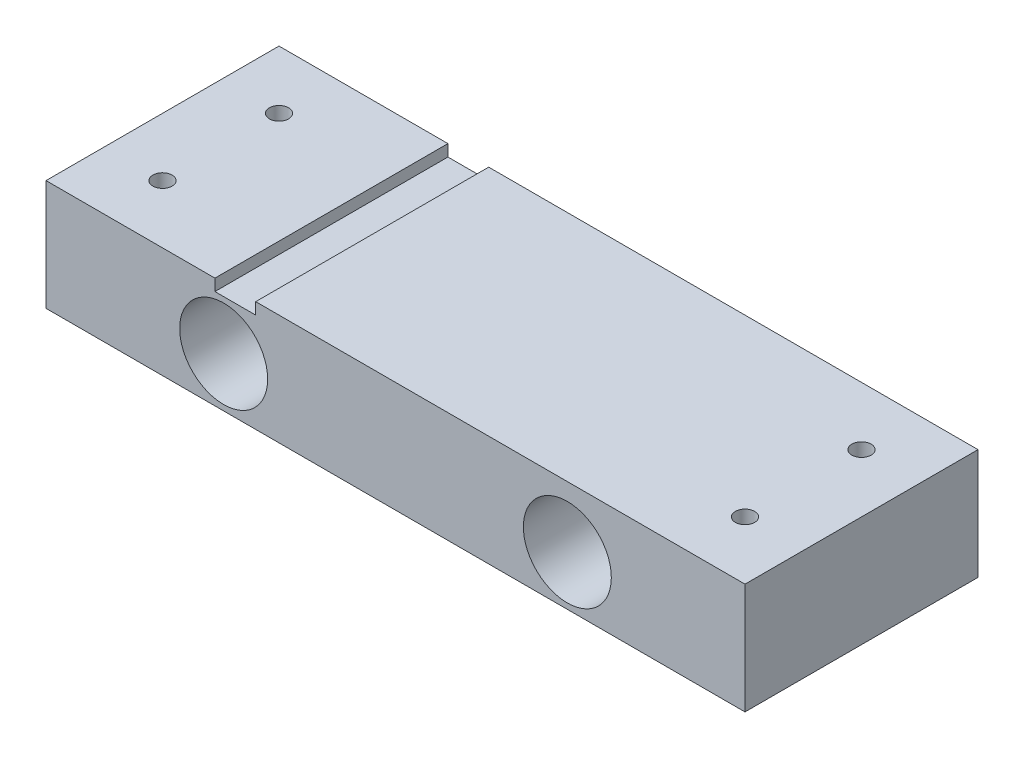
ISO-10303-21;
HEADER;
FILE_DESCRIPTION(('STEP AP214'),'2;1');
FILE_NAME('part.step','',(''),(''),'','','');
FILE_SCHEMA(('AUTOMOTIVE_DESIGN { 1 0 10303 214 1 1 1 1 }'));
ENDSEC;
DATA;
#1=APPLICATION_CONTEXT('core data for automotive mechanical design processes');
#2=APPLICATION_PROTOCOL_DEFINITION('international standard','automotive_design',2000,#1);
#3=PRODUCT_CONTEXT('',#1,'mechanical');
#4=PRODUCT('Part','Part','',(#3));
#5=PRODUCT_RELATED_PRODUCT_CATEGORY('part','',(#4));
#6=PRODUCT_DEFINITION_FORMATION('','',#4);
#7=PRODUCT_DEFINITION_CONTEXT('part definition',#1,'design');
#8=PRODUCT_DEFINITION('design','',#6,#7);
#9=PRODUCT_DEFINITION_SHAPE('','',#8);
#10=(LENGTH_UNIT() NAMED_UNIT(*) SI_UNIT(.MILLI.,.METRE.));
#11=(NAMED_UNIT(*) PLANE_ANGLE_UNIT() SI_UNIT($,.RADIAN.));
#12=(NAMED_UNIT(*) SI_UNIT($,.STERADIAN.) SOLID_ANGLE_UNIT());
#13=UNCERTAINTY_MEASURE_WITH_UNIT(LENGTH_MEASURE(1.E-05),#10,'distance_accuracy_value','');
#14=(GEOMETRIC_REPRESENTATION_CONTEXT(3) GLOBAL_UNCERTAINTY_ASSIGNED_CONTEXT((#13)) GLOBAL_UNIT_ASSIGNED_CONTEXT((#10,
#11,#12)) REPRESENTATION_CONTEXT('',''));
#15=CARTESIAN_POINT('',(0.,0.,0.));
#16=DIRECTION('',(0.,0.,1.));
#17=DIRECTION('',(1.,0.,0.));
#18=AXIS2_PLACEMENT_3D('',#15,#16,#17);
#19=CARTESIAN_POINT('',(0.,0.,40.));
#20=DIRECTION('',(0.,0.,1.));
#21=DIRECTION('',(1.,0.,0.));
#22=AXIS2_PLACEMENT_3D('',#19,#20,#21);
#23=PLANE('',#22);
#24=CARTESIAN_POINT('',(29.5,0.5,40.));
#25=DIRECTION('',(0.,0.,1.));
#26=DIRECTION('',(1.,0.,0.));
#27=AXIS2_PLACEMENT_3D('',#24,#25,#26);
#28=CIRCLE('',#27,7.55);
#29=CARTESIAN_POINT('',(37.05,0.5,40.));
#30=VERTEX_POINT('',#29);
#31=EDGE_CURVE('E138',#30,#30,#28,.T.);
#32=ORIENTED_EDGE('',*,*,#31,.F.);
#33=EDGE_LOOP('',(#32));
#34=FACE_BOUND('',#33,.T.);
#35=DIRECTION('',(-1.,0.,0.));
#36=VECTOR('',#35,1.);
#37=CARTESIAN_POINT('',(-24.,11.,40.));
#38=LINE('',#37,#36);
#39=CARTESIAN_POINT('',(60.,11.,40.));
#40=VERTEX_POINT('',#39);
#41=CARTESIAN_POINT('',(-24.,11.,40.));
#42=VERTEX_POINT('',#41);
#43=EDGE_CURVE('E149',#40,#42,#38,.T.);
#44=ORIENTED_EDGE('',*,*,#43,.T.);
#45=DIRECTION('',(0.,-1.,0.));
#46=VECTOR('',#45,1.);
#47=CARTESIAN_POINT('',(-24.,11.,40.));
#48=LINE('',#47,#46);
#49=CARTESIAN_POINT('',(-24.,9.,40.));
#50=VERTEX_POINT('',#49);
#51=EDGE_CURVE('E97',#42,#50,#48,.T.);
#52=ORIENTED_EDGE('',*,*,#51,.T.);
#53=DIRECTION('',(-1.,0.,0.));
#54=VECTOR('',#53,1.);
#55=CARTESIAN_POINT('',(-31.,9.,40.));
#56=LINE('',#55,#54);
#57=CARTESIAN_POINT('',(-31.,9.,40.));
#58=VERTEX_POINT('',#57);
#59=EDGE_CURVE('E164',#50,#58,#56,.T.);
#60=ORIENTED_EDGE('',*,*,#59,.T.);
#61=DIRECTION('',(0.,1.,0.));
#62=VECTOR('',#61,1.);
#63=CARTESIAN_POINT('',(-31.,11.,40.));
#64=LINE('',#63,#62);
#65=CARTESIAN_POINT('',(-31.,11.,40.));
#66=VERTEX_POINT('',#65);
#67=EDGE_CURVE('E177',#58,#66,#64,.T.);
#68=ORIENTED_EDGE('',*,*,#67,.T.);
#69=DIRECTION('',(-1.,0.,0.));
#70=VECTOR('',#69,1.);
#71=CARTESIAN_POINT('',(-60.,11.,40.));
#72=LINE('',#71,#70);
#73=CARTESIAN_POINT('',(-60.,11.,40.));
#74=VERTEX_POINT('',#73);
#75=EDGE_CURVE('E116',#66,#74,#72,.T.);
#76=ORIENTED_EDGE('',*,*,#75,.T.);
#77=DIRECTION('',(0.,-1.,0.));
#78=VECTOR('',#77,1.);
#79=CARTESIAN_POINT('',(-60.,-8.,40.));
#80=LINE('',#79,#78);
#81=CARTESIAN_POINT('',(-60.,-8.,40.));
#82=VERTEX_POINT('',#81);
#83=EDGE_CURVE('E110',#74,#82,#80,.T.);
#84=ORIENTED_EDGE('',*,*,#83,.T.);
#85=DIRECTION('',(1.,0.,0.));
#86=VECTOR('',#85,1.);
#87=CARTESIAN_POINT('',(-60.,-8.,40.));
#88=LINE('',#87,#86);
#89=CARTESIAN_POINT('',(60.,-8.,40.));
#90=VERTEX_POINT('',#89);
#91=EDGE_CURVE('E114',#82,#90,#88,.T.);
#92=ORIENTED_EDGE('',*,*,#91,.T.);
#93=DIRECTION('',(0.,1.,0.));
#94=VECTOR('',#93,1.);
#95=CARTESIAN_POINT('',(60.,-8.,40.));
#96=LINE('',#95,#94);
#97=EDGE_CURVE('E54',#90,#40,#96,.T.);
#98=ORIENTED_EDGE('',*,*,#97,.T.);
#99=EDGE_LOOP('',(#44,#52,#60,#68,#76,#84,#92,#98));
#100=FACE_BOUND('',#99,.T.);
#101=CARTESIAN_POINT('',(-29.5,0.5,40.));
#102=DIRECTION('',(0.,0.,1.));
#103=DIRECTION('',(1.,0.,0.));
#104=AXIS2_PLACEMENT_3D('',#101,#102,#103);
#105=CIRCLE('',#104,7.55);
#106=CARTESIAN_POINT('',(-21.95,0.5,40.));
#107=VERTEX_POINT('',#106);
#108=EDGE_CURVE('E186',#107,#107,#105,.T.);
#109=ORIENTED_EDGE('',*,*,#108,.F.);
#110=EDGE_LOOP('',(#109));
#111=FACE_BOUND('',#110,.T.);
#112=ADVANCED_FACE('F37',(#34,#100,#111),#23,.T.);
#113=CARTESIAN_POINT('',(0.,0.,0.));
#114=DIRECTION('',(0.,0.,1.));
#115=DIRECTION('',(1.,0.,0.));
#116=AXIS2_PLACEMENT_3D('',#113,#114,#115);
#117=PLANE('',#116);
#118=DIRECTION('',(-1.,0.,0.));
#119=VECTOR('',#118,1.);
#120=CARTESIAN_POINT('',(-24.,11.,0.));
#121=LINE('',#120,#119);
#122=CARTESIAN_POINT('',(60.,11.,0.));
#123=VERTEX_POINT('',#122);
#124=CARTESIAN_POINT('',(-24.,11.,0.));
#125=VERTEX_POINT('',#124);
#126=EDGE_CURVE('E134',#123,#125,#121,.T.);
#127=ORIENTED_EDGE('',*,*,#126,.F.);
#128=DIRECTION('',(0.,1.,0.));
#129=VECTOR('',#128,1.);
#130=CARTESIAN_POINT('',(60.,-8.,0.));
#131=LINE('',#130,#129);
#132=CARTESIAN_POINT('',(60.,-8.,0.));
#133=VERTEX_POINT('',#132);
#134=EDGE_CURVE('E89',#133,#123,#131,.T.);
#135=ORIENTED_EDGE('',*,*,#134,.F.);
#136=DIRECTION('',(1.,0.,0.));
#137=VECTOR('',#136,1.);
#138=CARTESIAN_POINT('',(-60.,-8.,0.));
#139=LINE('',#138,#137);
#140=CARTESIAN_POINT('',(-60.,-8.,0.));
#141=VERTEX_POINT('',#140);
#142=EDGE_CURVE('E83',#141,#133,#139,.T.);
#143=ORIENTED_EDGE('',*,*,#142,.F.);
#144=DIRECTION('',(0.,-1.,0.));
#145=VECTOR('',#144,1.);
#146=CARTESIAN_POINT('',(-60.,-8.,0.));
#147=LINE('',#146,#145);
#148=CARTESIAN_POINT('',(-60.,11.,0.));
#149=VERTEX_POINT('',#148);
#150=EDGE_CURVE('E124',#149,#141,#147,.T.);
#151=ORIENTED_EDGE('',*,*,#150,.F.);
#152=DIRECTION('',(-1.,0.,0.));
#153=VECTOR('',#152,1.);
#154=CARTESIAN_POINT('',(-60.,11.,0.));
#155=LINE('',#154,#153);
#156=CARTESIAN_POINT('',(-31.,11.,0.));
#157=VERTEX_POINT('',#156);
#158=EDGE_CURVE('E144',#157,#149,#155,.T.);
#159=ORIENTED_EDGE('',*,*,#158,.F.);
#160=DIRECTION('',(0.,1.,0.));
#161=VECTOR('',#160,1.);
#162=CARTESIAN_POINT('',(-31.,11.,0.));
#163=LINE('',#162,#161);
#164=CARTESIAN_POINT('',(-31.,9.,0.));
#165=VERTEX_POINT('',#164);
#166=EDGE_CURVE('E142',#165,#157,#163,.T.);
#167=ORIENTED_EDGE('',*,*,#166,.F.);
#168=DIRECTION('',(-1.,0.,0.));
#169=VECTOR('',#168,1.);
#170=CARTESIAN_POINT('',(-31.,9.,0.));
#171=LINE('',#170,#169);
#172=CARTESIAN_POINT('',(-24.,9.,0.));
#173=VERTEX_POINT('',#172);
#174=EDGE_CURVE('E140',#173,#165,#171,.T.);
#175=ORIENTED_EDGE('',*,*,#174,.F.);
#176=DIRECTION('',(0.,-1.,0.));
#177=VECTOR('',#176,1.);
#178=CARTESIAN_POINT('',(-24.,11.,0.));
#179=LINE('',#178,#177);
#180=EDGE_CURVE('E137',#125,#173,#179,.T.);
#181=ORIENTED_EDGE('',*,*,#180,.F.);
#182=EDGE_LOOP('',(#127,#135,#143,#151,#159,#167,#175,#181));
#183=FACE_BOUND('',#182,.T.);
#184=CARTESIAN_POINT('',(29.5,0.5,0.));
#185=DIRECTION('',(0.,0.,1.));
#186=DIRECTION('',(1.,0.,0.));
#187=AXIS2_PLACEMENT_3D('',#184,#185,#186);
#188=CIRCLE('',#187,7.55);
#189=CARTESIAN_POINT('',(37.05,0.5,0.));
#190=VERTEX_POINT('',#189);
#191=EDGE_CURVE('E183',#190,#190,#188,.T.);
#192=ORIENTED_EDGE('',*,*,#191,.T.);
#193=EDGE_LOOP('',(#192));
#194=FACE_BOUND('',#193,.T.);
#195=CARTESIAN_POINT('',(-29.5,0.5,0.));
#196=DIRECTION('',(0.,0.,1.));
#197=DIRECTION('',(1.,0.,0.));
#198=AXIS2_PLACEMENT_3D('',#195,#196,#197);
#199=CIRCLE('',#198,7.55);
#200=CARTESIAN_POINT('',(-21.95,0.5,0.));
#201=VERTEX_POINT('',#200);
#202=EDGE_CURVE('E189',#201,#201,#199,.T.);
#203=ORIENTED_EDGE('',*,*,#202,.T.);
#204=EDGE_LOOP('',(#203));
#205=FACE_BOUND('',#204,.T.);
#206=ADVANCED_FACE('F168',(#183,#194,#205),#117,.F.);
#207=CARTESIAN_POINT('',(-24.,11.,40.));
#208=DIRECTION('',(0.,-1.,0.));
#209=DIRECTION('',(0.,0.,-1.));
#210=AXIS2_PLACEMENT_3D('',#207,#208,#209);
#211=PLANE('',#210);
#212=CARTESIAN_POINT('',(50.,11.,30.));
#213=DIRECTION('',(0.,1.,0.));
#214=DIRECTION('',(-1.,0.,0.));
#215=AXIS2_PLACEMENT_3D('',#212,#213,#214);
#216=CIRCLE('',#215,1.65);
#217=CARTESIAN_POINT('',(48.35,11.,30.));
#218=VERTEX_POINT('',#217);
#219=EDGE_CURVE('E210',#218,#218,#216,.T.);
#220=ORIENTED_EDGE('',*,*,#219,.F.);
#221=EDGE_LOOP('',(#220));
#222=FACE_BOUND('',#221,.T.);
#223=CARTESIAN_POINT('',(50.,11.,10.));
#224=DIRECTION('',(0.,1.,0.));
#225=DIRECTION('',(-1.,0.,0.));
#226=AXIS2_PLACEMENT_3D('',#223,#224,#225);
#227=CIRCLE('',#226,1.65);
#228=CARTESIAN_POINT('',(48.35,11.,10.));
#229=VERTEX_POINT('',#228);
#230=EDGE_CURVE('E198',#229,#229,#227,.T.);
#231=ORIENTED_EDGE('',*,*,#230,.F.);
#232=EDGE_LOOP('',(#231));
#233=FACE_BOUND('',#232,.T.);
#234=ORIENTED_EDGE('',*,*,#126,.T.);
#235=DIRECTION('',(0.,0.,-1.));
#236=VECTOR('',#235,1.);
#237=CARTESIAN_POINT('',(-24.,11.,40.));
#238=LINE('',#237,#236);
#239=EDGE_CURVE('E11',#42,#125,#238,.T.);
#240=ORIENTED_EDGE('',*,*,#239,.F.);
#241=ORIENTED_EDGE('',*,*,#43,.F.);
#242=DIRECTION('',(0.,0.,-1.));
#243=VECTOR('',#242,1.);
#244=CARTESIAN_POINT('',(60.,11.,40.));
#245=LINE('',#244,#243);
#246=EDGE_CURVE('E130',#40,#123,#245,.T.);
#247=ORIENTED_EDGE('',*,*,#246,.T.);
#248=EDGE_LOOP('',(#234,#240,#241,#247));
#249=FACE_BOUND('',#248,.T.);
#250=ADVANCED_FACE('F39',(#222,#233,#249),#211,.F.);
#251=CARTESIAN_POINT('',(-24.,11.,40.));
#252=DIRECTION('',(1.,0.,0.));
#253=DIRECTION('',(0.,0.,-1.));
#254=AXIS2_PLACEMENT_3D('',#251,#252,#253);
#255=PLANE('',#254);
#256=ORIENTED_EDGE('',*,*,#180,.T.);
#257=DIRECTION('',(0.,0.,-1.));
#258=VECTOR('',#257,1.);
#259=CARTESIAN_POINT('',(-24.,9.,40.));
#260=LINE('',#259,#258);
#261=EDGE_CURVE('E46',#50,#173,#260,.T.);
#262=ORIENTED_EDGE('',*,*,#261,.F.);
#263=ORIENTED_EDGE('',*,*,#51,.F.);
#264=ORIENTED_EDGE('',*,*,#239,.T.);
#265=EDGE_LOOP('',(#256,#262,#263,#264));
#266=FACE_BOUND('',#265,.T.);
#267=ADVANCED_FACE('F223',(#266),#255,.F.);
#268=CARTESIAN_POINT('',(-31.,9.,40.));
#269=DIRECTION('',(0.,-1.,0.));
#270=DIRECTION('',(0.,0.,-1.));
#271=AXIS2_PLACEMENT_3D('',#268,#269,#270);
#272=PLANE('',#271);
#273=ORIENTED_EDGE('',*,*,#174,.T.);
#274=DIRECTION('',(0.,0.,-1.));
#275=VECTOR('',#274,1.);
#276=CARTESIAN_POINT('',(-31.,9.,40.));
#277=LINE('',#276,#275);
#278=EDGE_CURVE('E156',#58,#165,#277,.T.);
#279=ORIENTED_EDGE('',*,*,#278,.F.);
#280=ORIENTED_EDGE('',*,*,#59,.F.);
#281=ORIENTED_EDGE('',*,*,#261,.T.);
#282=EDGE_LOOP('',(#273,#279,#280,#281));
#283=FACE_BOUND('',#282,.T.);
#284=ADVANCED_FACE('F162',(#283),#272,.F.);
#285=CARTESIAN_POINT('',(-31.,11.,40.));
#286=DIRECTION('',(-1.,0.,0.));
#287=DIRECTION('',(0.,0.,1.));
#288=AXIS2_PLACEMENT_3D('',#285,#286,#287);
#289=PLANE('',#288);
#290=ORIENTED_EDGE('',*,*,#166,.T.);
#291=DIRECTION('',(0.,0.,-1.));
#292=VECTOR('',#291,1.);
#293=CARTESIAN_POINT('',(-31.,11.,40.));
#294=LINE('',#293,#292);
#295=EDGE_CURVE('E153',#66,#157,#294,.T.);
#296=ORIENTED_EDGE('',*,*,#295,.F.);
#297=ORIENTED_EDGE('',*,*,#67,.F.);
#298=ORIENTED_EDGE('',*,*,#278,.T.);
#299=EDGE_LOOP('',(#290,#296,#297,#298));
#300=FACE_BOUND('',#299,.T.);
#301=ADVANCED_FACE('F173',(#300),#289,.F.);
#302=CARTESIAN_POINT('',(-60.,11.,40.));
#303=DIRECTION('',(0.,-1.,0.));
#304=DIRECTION('',(0.,0.,-1.));
#305=AXIS2_PLACEMENT_3D('',#302,#303,#304);
#306=PLANE('',#305);
#307=CARTESIAN_POINT('',(-50.,11.,30.));
#308=DIRECTION('',(0.,1.,0.));
#309=DIRECTION('',(-1.,0.,0.));
#310=AXIS2_PLACEMENT_3D('',#307,#308,#309);
#311=CIRCLE('',#310,1.65);
#312=CARTESIAN_POINT('',(-51.65,11.,30.));
#313=VERTEX_POINT('',#312);
#314=EDGE_CURVE('E204',#313,#313,#311,.T.);
#315=ORIENTED_EDGE('',*,*,#314,.F.);
#316=EDGE_LOOP('',(#315));
#317=FACE_BOUND('',#316,.T.);
#318=CARTESIAN_POINT('',(-50.,11.,10.));
#319=DIRECTION('',(0.,1.,0.));
#320=DIRECTION('',(-1.,0.,0.));
#321=AXIS2_PLACEMENT_3D('',#318,#319,#320);
#322=CIRCLE('',#321,1.65);
#323=CARTESIAN_POINT('',(-51.65,11.,10.));
#324=VERTEX_POINT('',#323);
#325=EDGE_CURVE('E195',#324,#324,#322,.T.);
#326=ORIENTED_EDGE('',*,*,#325,.F.);
#327=EDGE_LOOP('',(#326));
#328=FACE_BOUND('',#327,.T.);
#329=ORIENTED_EDGE('',*,*,#158,.T.);
#330=DIRECTION('',(0.,0.,-1.));
#331=VECTOR('',#330,1.);
#332=CARTESIAN_POINT('',(-60.,11.,40.));
#333=LINE('',#332,#331);
#334=EDGE_CURVE('E125',#74,#149,#333,.T.);
#335=ORIENTED_EDGE('',*,*,#334,.F.);
#336=ORIENTED_EDGE('',*,*,#75,.F.);
#337=ORIENTED_EDGE('',*,*,#295,.T.);
#338=EDGE_LOOP('',(#329,#335,#336,#337));
#339=FACE_BOUND('',#338,.T.);
#340=ADVANCED_FACE('F176',(#317,#328,#339),#306,.F.);
#341=CARTESIAN_POINT('',(-60.,-8.,40.));
#342=DIRECTION('',(1.,0.,0.));
#343=DIRECTION('',(0.,0.,-1.));
#344=AXIS2_PLACEMENT_3D('',#341,#342,#343);
#345=PLANE('',#344);
#346=ORIENTED_EDGE('',*,*,#150,.T.);
#347=DIRECTION('',(0.,0.,-1.));
#348=VECTOR('',#347,1.);
#349=CARTESIAN_POINT('',(-60.,-8.,40.));
#350=LINE('',#349,#348);
#351=EDGE_CURVE('E121',#82,#141,#350,.T.);
#352=ORIENTED_EDGE('',*,*,#351,.F.);
#353=ORIENTED_EDGE('',*,*,#83,.F.);
#354=ORIENTED_EDGE('',*,*,#334,.T.);
#355=EDGE_LOOP('',(#346,#352,#353,#354));
#356=FACE_BOUND('',#355,.T.);
#357=ADVANCED_FACE('F122',(#356),#345,.F.);
#358=CARTESIAN_POINT('',(-60.,-8.,40.));
#359=DIRECTION('',(0.,1.,0.));
#360=DIRECTION('',(0.,0.,1.));
#361=AXIS2_PLACEMENT_3D('',#358,#359,#360);
#362=PLANE('',#361);
#363=ORIENTED_EDGE('',*,*,#142,.T.);
#364=DIRECTION('',(0.,0.,-1.));
#365=VECTOR('',#364,1.);
#366=CARTESIAN_POINT('',(60.,-8.,40.));
#367=LINE('',#366,#365);
#368=EDGE_CURVE('E126',#90,#133,#367,.T.);
#369=ORIENTED_EDGE('',*,*,#368,.F.);
#370=ORIENTED_EDGE('',*,*,#91,.F.);
#371=ORIENTED_EDGE('',*,*,#351,.T.);
#372=EDGE_LOOP('',(#363,#369,#370,#371));
#373=FACE_BOUND('',#372,.T.);
#374=ADVANCED_FACE('F128',(#373),#362,.F.);
#375=CARTESIAN_POINT('',(60.,-8.,40.));
#376=DIRECTION('',(-1.,0.,0.));
#377=DIRECTION('',(0.,0.,1.));
#378=AXIS2_PLACEMENT_3D('',#375,#376,#377);
#379=PLANE('',#378);
#380=ORIENTED_EDGE('',*,*,#134,.T.);
#381=ORIENTED_EDGE('',*,*,#246,.F.);
#382=ORIENTED_EDGE('',*,*,#97,.F.);
#383=ORIENTED_EDGE('',*,*,#368,.T.);
#384=EDGE_LOOP('',(#380,#381,#382,#383));
#385=FACE_BOUND('',#384,.T.);
#386=ADVANCED_FACE('F227',(#385),#379,.F.);
#387=CARTESIAN_POINT('',(29.5,0.5,40.));
#388=DIRECTION('',(0.,0.,-1.));
#389=DIRECTION('',(-1.,0.,0.));
#390=AXIS2_PLACEMENT_3D('',#387,#388,#389);
#391=CYLINDRICAL_SURFACE('',#390,7.55);
#392=ORIENTED_EDGE('',*,*,#31,.T.);
#393=EDGE_LOOP('',(#392));
#394=FACE_BOUND('',#393,.T.);
#395=ORIENTED_EDGE('',*,*,#191,.F.);
#396=EDGE_LOOP('',(#395));
#397=FACE_BOUND('',#396,.T.);
#398=ADVANCED_FACE('F229',(#394,#397),#391,.F.);
#399=CARTESIAN_POINT('',(-29.5,0.5,40.));
#400=DIRECTION('',(0.,0.,-1.));
#401=DIRECTION('',(-1.,0.,0.));
#402=AXIS2_PLACEMENT_3D('',#399,#400,#401);
#403=CYLINDRICAL_SURFACE('',#402,7.55);
#404=ORIENTED_EDGE('',*,*,#108,.T.);
#405=EDGE_LOOP('',(#404));
#406=FACE_BOUND('',#405,.T.);
#407=ORIENTED_EDGE('',*,*,#202,.F.);
#408=EDGE_LOOP('',(#407));
#409=FACE_BOUND('',#408,.T.);
#410=ADVANCED_FACE('F235',(#406,#409),#403,.F.);
#411=CARTESIAN_POINT('',(-50.,6.00000000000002,10.));
#412=DIRECTION('',(0.,1.,0.));
#413=DIRECTION('',(-1.,0.,0.));
#414=AXIS2_PLACEMENT_3D('',#411,#412,#413);
#415=CYLINDRICAL_SURFACE('',#414,1.65);
#416=CARTESIAN_POINT('',(-50.,6.00000000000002,10.));
#417=DIRECTION('',(0.,1.,0.));
#418=DIRECTION('',(-1.,0.,0.));
#419=AXIS2_PLACEMENT_3D('',#416,#417,#418);
#420=CIRCLE('',#419,1.65);
#421=CARTESIAN_POINT('',(-51.65,6.00000000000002,10.));
#422=VERTEX_POINT('',#421);
#423=EDGE_CURVE('E192',#422,#422,#420,.T.);
#424=ORIENTED_EDGE('',*,*,#423,.F.);
#425=EDGE_LOOP('',(#424));
#426=FACE_BOUND('',#425,.T.);
#427=ORIENTED_EDGE('',*,*,#325,.T.);
#428=EDGE_LOOP('',(#427));
#429=FACE_BOUND('',#428,.T.);
#430=ADVANCED_FACE('F250',(#426,#429),#415,.F.);
#431=CARTESIAN_POINT('',(-50.,6.00000000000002,10.));
#432=DIRECTION('',(0.,1.,0.));
#433=DIRECTION('',(-1.,0.,0.));
#434=AXIS2_PLACEMENT_3D('',#431,#432,#433);
#435=PLANE('',#434);
#436=ORIENTED_EDGE('',*,*,#423,.T.);
#437=EDGE_LOOP('',(#436));
#438=FACE_BOUND('',#437,.T.);
#439=ADVANCED_FACE('F254',(#438),#435,.T.);
#440=CARTESIAN_POINT('',(-50.,6.00000000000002,30.));
#441=DIRECTION('',(0.,1.,0.));
#442=DIRECTION('',(-1.,0.,0.));
#443=AXIS2_PLACEMENT_3D('',#440,#441,#442);
#444=CYLINDRICAL_SURFACE('',#443,1.65);
#445=CARTESIAN_POINT('',(-50.,6.00000000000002,30.));
#446=DIRECTION('',(0.,1.,0.));
#447=DIRECTION('',(-1.,0.,0.));
#448=AXIS2_PLACEMENT_3D('',#445,#446,#447);
#449=CIRCLE('',#448,1.65);
#450=CARTESIAN_POINT('',(-51.65,6.00000000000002,30.));
#451=VERTEX_POINT('',#450);
#452=EDGE_CURVE('E201',#451,#451,#449,.T.);
#453=ORIENTED_EDGE('',*,*,#452,.F.);
#454=EDGE_LOOP('',(#453));
#455=FACE_BOUND('',#454,.T.);
#456=ORIENTED_EDGE('',*,*,#314,.T.);
#457=EDGE_LOOP('',(#456));
#458=FACE_BOUND('',#457,.T.);
#459=ADVANCED_FACE('F258',(#455,#458),#444,.F.);
#460=CARTESIAN_POINT('',(-50.,6.00000000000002,30.));
#461=DIRECTION('',(0.,1.,0.));
#462=DIRECTION('',(-1.,0.,0.));
#463=AXIS2_PLACEMENT_3D('',#460,#461,#462);
#464=PLANE('',#463);
#465=ORIENTED_EDGE('',*,*,#452,.T.);
#466=EDGE_LOOP('',(#465));
#467=FACE_BOUND('',#466,.T.);
#468=ADVANCED_FACE('F260',(#467),#464,.T.);
#469=CARTESIAN_POINT('',(50.,5.99999999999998,10.));
#470=DIRECTION('',(0.,1.,0.));
#471=DIRECTION('',(-1.,0.,0.));
#472=AXIS2_PLACEMENT_3D('',#469,#470,#471);
#473=CYLINDRICAL_SURFACE('',#472,1.65);
#474=CARTESIAN_POINT('',(50.,5.99999999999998,10.));
#475=DIRECTION('',(0.,1.,0.));
#476=DIRECTION('',(-1.,0.,0.));
#477=AXIS2_PLACEMENT_3D('',#474,#475,#476);
#478=CIRCLE('',#477,1.65);
#479=CARTESIAN_POINT('',(48.35,5.99999999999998,10.));
#480=VERTEX_POINT('',#479);
#481=EDGE_CURVE('E213',#480,#480,#478,.T.);
#482=ORIENTED_EDGE('',*,*,#481,.F.);
#483=EDGE_LOOP('',(#482));
#484=FACE_BOUND('',#483,.T.);
#485=ORIENTED_EDGE('',*,*,#230,.T.);
#486=EDGE_LOOP('',(#485));
#487=FACE_BOUND('',#486,.T.);
#488=ADVANCED_FACE('F219',(#484,#487),#473,.F.);
#489=CARTESIAN_POINT('',(50.,5.99999999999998,10.));
#490=DIRECTION('',(0.,1.,0.));
#491=DIRECTION('',(-1.,0.,0.));
#492=AXIS2_PLACEMENT_3D('',#489,#490,#491);
#493=PLANE('',#492);
#494=ORIENTED_EDGE('',*,*,#481,.T.);
#495=EDGE_LOOP('',(#494));
#496=FACE_BOUND('',#495,.T.);
#497=ADVANCED_FACE('F274',(#496),#493,.T.);
#498=CARTESIAN_POINT('',(50.,5.99999999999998,30.));
#499=DIRECTION('',(0.,1.,0.));
#500=DIRECTION('',(-1.,0.,0.));
#501=AXIS2_PLACEMENT_3D('',#498,#499,#500);
#502=CYLINDRICAL_SURFACE('',#501,1.65);
#503=CARTESIAN_POINT('',(50.,5.99999999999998,30.));
#504=DIRECTION('',(0.,1.,0.));
#505=DIRECTION('',(-1.,0.,0.));
#506=AXIS2_PLACEMENT_3D('',#503,#504,#505);
#507=CIRCLE('',#506,1.65);
#508=CARTESIAN_POINT('',(48.35,5.99999999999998,30.));
#509=VERTEX_POINT('',#508);
#510=EDGE_CURVE('E207',#509,#509,#507,.T.);
#511=ORIENTED_EDGE('',*,*,#510,.F.);
#512=EDGE_LOOP('',(#511));
#513=FACE_BOUND('',#512,.T.);
#514=ORIENTED_EDGE('',*,*,#219,.T.);
#515=EDGE_LOOP('',(#514));
#516=FACE_BOUND('',#515,.T.);
#517=ADVANCED_FACE('F270',(#513,#516),#502,.F.);
#518=CARTESIAN_POINT('',(50.,5.99999999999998,30.));
#519=DIRECTION('',(0.,1.,0.));
#520=DIRECTION('',(-1.,0.,0.));
#521=AXIS2_PLACEMENT_3D('',#518,#519,#520);
#522=PLANE('',#521);
#523=ORIENTED_EDGE('',*,*,#510,.T.);
#524=EDGE_LOOP('',(#523));
#525=FACE_BOUND('',#524,.T.);
#526=ADVANCED_FACE('F267',(#525),#522,.T.);
#527=CLOSED_SHELL('',(#112,#206,#250,#267,#284,#301,#340,#357,#374,#386,#398,#410,#430,#439,
#459,#468,#488,#497,#517,#526));
#528=MANIFOLD_SOLID_BREP('B2',#527);
#529=ADVANCED_BREP_SHAPE_REPRESENTATION('',(#18,#528),#14);
#530=SHAPE_DEFINITION_REPRESENTATION(#9,#529);
ENDSEC;
END-ISO-10303-21;
